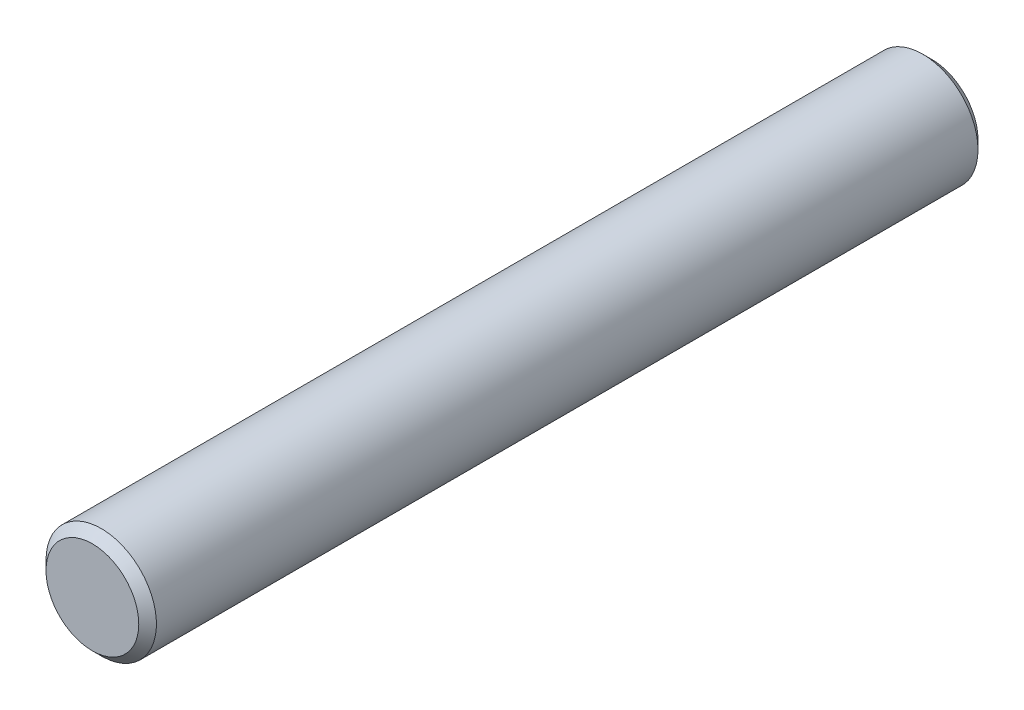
from build123d import *

# Parameters (mm, degrees)
SKETCH1_R      = 1.5875
EXTRUDE1_DEPTH = 24.13
CHAMFER1_SIZE  = 0.254


with BuildPart() as part:
    # Sketch1 → Extrude1 (new body)
    with BuildSketch(Plane.XY):
        with Locations(Location((0, 0, 0), (0, 0, 180))):
            Circle(SKETCH1_R)
    extrude(amount=EXTRUDE1_DEPTH)

    # Chamfer1
    chamfer1_edges = [part.edges().sort_by_distance(p)[0] for p in [
        (1.5875, 0, 0),
        (1.5875, 0, 24.13),
    ]]
    chamfer(chamfer1_edges, length=CHAMFER1_SIZE)


solid = part.part
